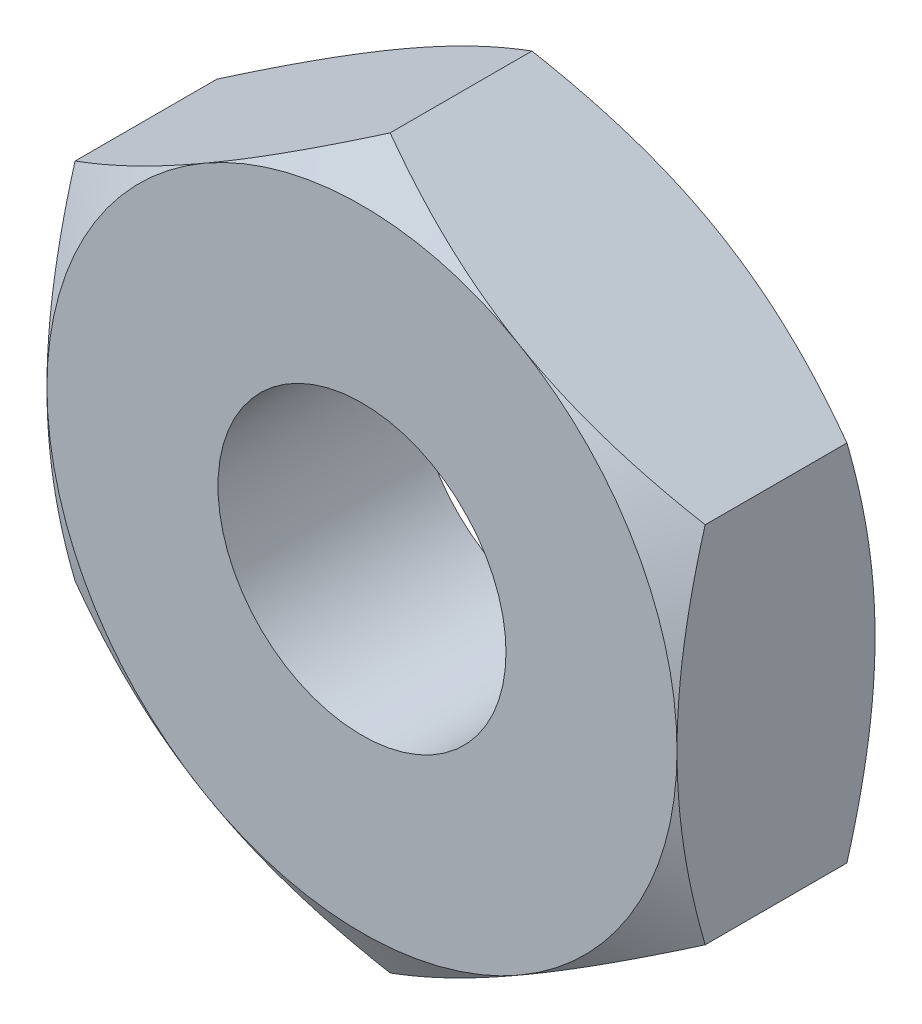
from build123d import *

# Parameters (mm, degrees)
BASE_EXTRUSION_DEPTH    = 2.2
ESQUISSE3_R             = 1.6
ENL_V_MAT_EXTRU_1_DEPTH = 6.781291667


with BuildPart() as part:
    # Esquisse1 → Base-Extrusion (new body)
    with BuildSketch(Plane.XY):
        Polygon((3.5, -2.020725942), (3.5, 2.020725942), (0, 4.041451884), (-3.5, 2.020725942), (-3.5, -2.020725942), (0, -4.041451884), align=None)
    extrude(amount=-BASE_EXTRUSION_DEPTH)

    # Esquisse2 → Enl_vement de mati_re-R_volution1 (revolve, cut)
    with BuildSketch(Plane(origin=(0, 0, 0), x_dir=(1, 0, 0), z_dir=(0, 1, 0)), mode=Mode.PRIVATE) as enl_vement_de_mati_re_r_volution1_sk:
        Polygon((-3.5, 0), (-6.405255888, 0), (-6.405255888, 2.2), (-3.5, 2.2), (-5.405255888, 1.1), align=None)
    revolve(enl_vement_de_mati_re_r_volution1_sk.sketch.rotate(Axis((0, 0, -2.2), (0, 0, 1)), 180), axis=Axis((0, 0, -2.2), (0, 0, 1)), mode=Mode.SUBTRACT)

    # Esquisse3 → Enl_v. mat.-Extru.1 (cut, through all)
    with BuildSketch(Plane.XY):
        Circle(ESQUISSE3_R)
    extrude(amount=-ENL_V_MAT_EXTRU_1_DEPTH, mode=Mode.SUBTRACT)


solid = part.part
